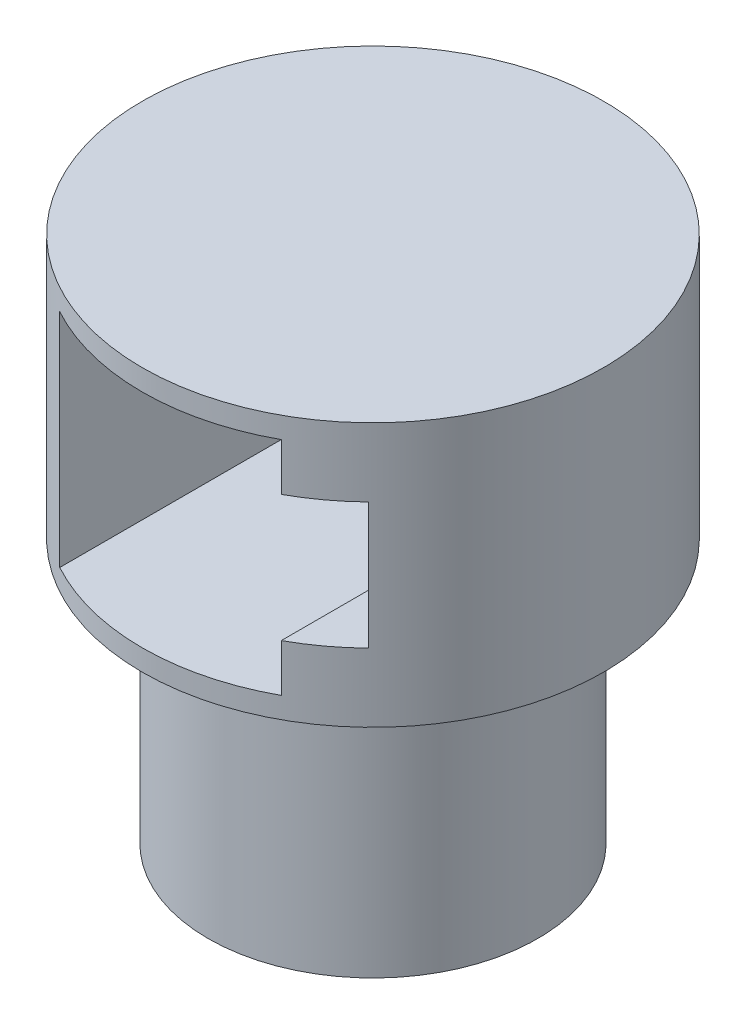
from build123d import *

# Parameters (mm, degrees)
SKETCH2_R               = 31.75
BOSS_EXTRUDE1_DEPTH     = 101.6
CUT_EXTRUDE1_DEPTH      = 25.4
SKETCH18_R              = 44.45
BOSS_EXTRUDE2_DEPTH     = 50.8
CUT_EXTRUDE7_DEPTH      = 120.474537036
CUT_EXTRUDE7_DEPTH_BACK = 5.588
SKETCH16_R              = 2.667
SKETCH17_W              = 42.672
SKETCH17_H              = 42.672
SKETCH17_W_2            = 9.652
SKETCH17_H_2            = 24.384
CUT_EXTRUDE9_DEPTH      = 50.8


with BuildPart() as part:
    # Sketch2 → Boss-Extrude1 (new body)
    with BuildSketch(Plane(origin=(0, 0, 0), x_dir=(1, 0, 0), z_dir=(0, 1, 0))):
        with Locations(Location((0, 0, 0), (0, 0, 270))):
            Circle(SKETCH2_R)
    extrude(amount=BOSS_EXTRUDE1_DEPTH)

    # Sketch4 → Cut-Extrude1 (cut)
    with BuildSketch(Plane(origin=(0, 0, 0), x_dir=(-1, 0, 0), z_dir=(0, -1, 0))):
        with BuildLine():
            Line((-1.866511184, -1.905), (1.866511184, -1.905))
            ThreePointArc((1.866511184, -1.905), (2.458747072, -1.033175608), (2.667, 0))
            ThreePointArc((2.667, 0), (-1.033175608, 2.458747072), (-1.866511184, -1.905))
        make_face()
    extrude(amount=-CUT_EXTRUDE1_DEPTH, mode=Mode.SUBTRACT)

    # Sketch18 → Boss-Extrude2 (add)
    with BuildSketch(Plane(origin=(0, 101.6, 0), x_dir=(1, 0, 0), z_dir=(0, 1, 0))):
        with Locations(Location((0, 0, 0), (0, 0, 270))):
            Circle(SKETCH18_R)
    extrude(amount=-BOSS_EXTRUDE2_DEPTH)

    # Sketch16 → Cut-Extrude7 (cut, two sides: drawn at the far end of the back side and taken through both)
    with BuildSketch(Plane.XZ.offset(-CUT_EXTRUDE7_DEPTH_BACK)):
        with Locations(Location((0, 0, 0), (0, 0, 134.415308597))):
            Circle(SKETCH16_R)
    extrude(amount=CUT_EXTRUDE7_DEPTH + CUT_EXTRUDE7_DEPTH_BACK, mode=Mode.SUBTRACT)

    # Sketch17 → Cut-Extrude9 (cut)
    with BuildSketch(Plane.XY.offset(44.45)):
        with Locations((0, 76.2)):
            Rectangle(SKETCH17_W, SKETCH17_H)
        with Locations((26.162, 76.2)):
            Rectangle(SKETCH17_W_2, SKETCH17_H_2)
    extrude(amount=-CUT_EXTRUDE9_DEPTH, mode=Mode.SUBTRACT)


solid = part.part
